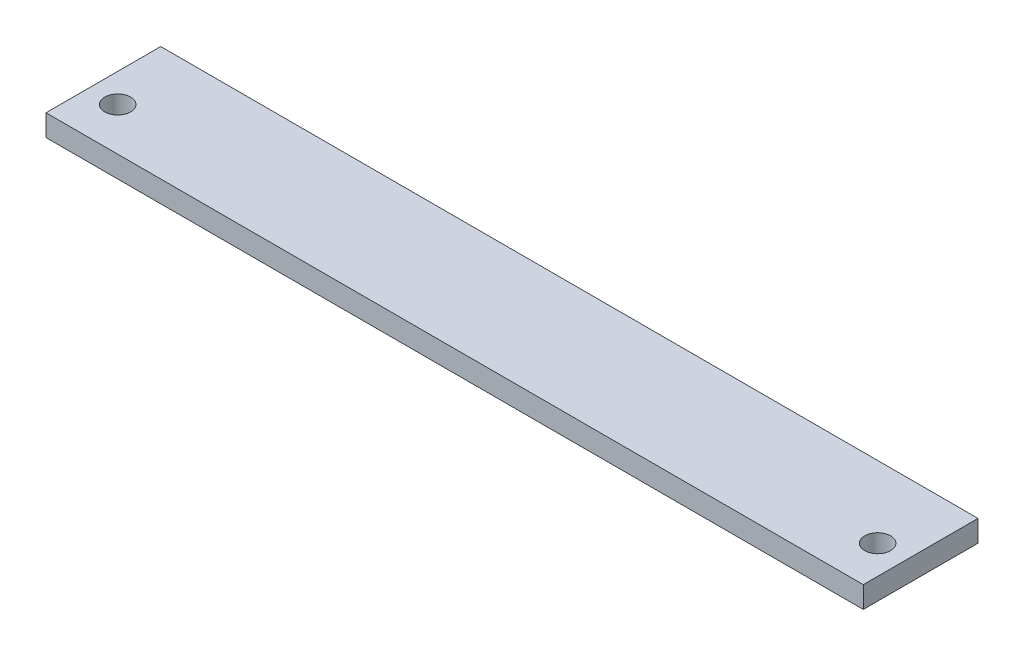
ISO-10303-21;
HEADER;
FILE_DESCRIPTION(('STEP AP214'),'2;1');
FILE_NAME('part.step','',(''),(''),'','','');
FILE_SCHEMA(('AUTOMOTIVE_DESIGN { 1 0 10303 214 1 1 1 1 }'));
ENDSEC;
DATA;
#1=APPLICATION_CONTEXT('core data for automotive mechanical design processes');
#2=APPLICATION_PROTOCOL_DEFINITION('international standard','automotive_design',2000,#1);
#3=PRODUCT_CONTEXT('',#1,'mechanical');
#4=PRODUCT('Part','Part','',(#3));
#5=PRODUCT_RELATED_PRODUCT_CATEGORY('part','',(#4));
#6=PRODUCT_DEFINITION_FORMATION('','',#4);
#7=PRODUCT_DEFINITION_CONTEXT('part definition',#1,'design');
#8=PRODUCT_DEFINITION('design','',#6,#7);
#9=PRODUCT_DEFINITION_SHAPE('','',#8);
#10=(LENGTH_UNIT() NAMED_UNIT(*) SI_UNIT(.MILLI.,.METRE.));
#11=(NAMED_UNIT(*) PLANE_ANGLE_UNIT() SI_UNIT($,.RADIAN.));
#12=(NAMED_UNIT(*) SI_UNIT($,.STERADIAN.) SOLID_ANGLE_UNIT());
#13=UNCERTAINTY_MEASURE_WITH_UNIT(LENGTH_MEASURE(1.E-05),#10,'distance_accuracy_value','');
#14=(GEOMETRIC_REPRESENTATION_CONTEXT(3) GLOBAL_UNCERTAINTY_ASSIGNED_CONTEXT((#13)) GLOBAL_UNIT_ASSIGNED_CONTEXT((#10,
#11,#12)) REPRESENTATION_CONTEXT('',''));
#15=CARTESIAN_POINT('',(0.,0.,0.));
#16=DIRECTION('',(0.,0.,1.));
#17=DIRECTION('',(1.,0.,0.));
#18=AXIS2_PLACEMENT_3D('',#15,#16,#17);
#19=CARTESIAN_POINT('',(-285.,15.,40.));
#20=DIRECTION('',(1.,0.,0.));
#21=DIRECTION('',(0.,0.,-1.));
#22=AXIS2_PLACEMENT_3D('',#19,#20,#21);
#23=PLANE('',#22);
#24=DIRECTION('',(0.,0.,1.));
#25=VECTOR('',#24,1.);
#26=CARTESIAN_POINT('',(-285.,0.,40.));
#27=LINE('',#26,#25);
#28=CARTESIAN_POINT('',(-285.,0.,-40.));
#29=VERTEX_POINT('',#28);
#30=CARTESIAN_POINT('',(-285.,0.,40.));
#31=VERTEX_POINT('',#30);
#32=EDGE_CURVE('E95',#29,#31,#27,.T.);
#33=ORIENTED_EDGE('',*,*,#32,.T.);
#34=DIRECTION('',(0.,-1.,0.));
#35=VECTOR('',#34,1.);
#36=CARTESIAN_POINT('',(-285.,15.,40.));
#37=LINE('',#36,#35);
#38=CARTESIAN_POINT('',(-285.,15.,40.));
#39=VERTEX_POINT('',#38);
#40=EDGE_CURVE('E11',#39,#31,#37,.T.);
#41=ORIENTED_EDGE('',*,*,#40,.F.);
#42=DIRECTION('',(0.,0.,1.));
#43=VECTOR('',#42,1.);
#44=CARTESIAN_POINT('',(-285.,15.,40.));
#45=LINE('',#44,#43);
#46=CARTESIAN_POINT('',(-285.,15.,-40.));
#47=VERTEX_POINT('',#46);
#48=EDGE_CURVE('E83',#47,#39,#45,.T.);
#49=ORIENTED_EDGE('',*,*,#48,.F.);
#50=DIRECTION('',(0.,-1.,0.));
#51=VECTOR('',#50,1.);
#52=CARTESIAN_POINT('',(-285.,15.,-40.));
#53=LINE('',#52,#51);
#54=EDGE_CURVE('E91',#47,#29,#53,.T.);
#55=ORIENTED_EDGE('',*,*,#54,.T.);
#56=EDGE_LOOP('',(#33,#41,#49,#55));
#57=FACE_BOUND('',#56,.T.);
#58=ADVANCED_FACE('F32',(#57),#23,.F.);
#59=CARTESIAN_POINT('',(285.,15.,40.));
#60=DIRECTION('',(0.,0.,-1.));
#61=DIRECTION('',(-1.,0.,0.));
#62=AXIS2_PLACEMENT_3D('',#59,#60,#61);
#63=PLANE('',#62);
#64=DIRECTION('',(1.,0.,0.));
#65=VECTOR('',#64,1.);
#66=CARTESIAN_POINT('',(285.,0.,40.));
#67=LINE('',#66,#65);
#68=CARTESIAN_POINT('',(285.,0.,40.));
#69=VERTEX_POINT('',#68);
#70=EDGE_CURVE('E87',#31,#69,#67,.T.);
#71=ORIENTED_EDGE('',*,*,#70,.T.);
#72=DIRECTION('',(0.,-1.,0.));
#73=VECTOR('',#72,1.);
#74=CARTESIAN_POINT('',(285.,15.,40.));
#75=LINE('',#74,#73);
#76=CARTESIAN_POINT('',(285.,15.,40.));
#77=VERTEX_POINT('',#76);
#78=EDGE_CURVE('E40',#77,#69,#75,.T.);
#79=ORIENTED_EDGE('',*,*,#78,.F.);
#80=DIRECTION('',(1.,0.,0.));
#81=VECTOR('',#80,1.);
#82=CARTESIAN_POINT('',(285.,15.,40.));
#83=LINE('',#82,#81);
#84=EDGE_CURVE('E78',#39,#77,#83,.T.);
#85=ORIENTED_EDGE('',*,*,#84,.F.);
#86=ORIENTED_EDGE('',*,*,#40,.T.);
#87=EDGE_LOOP('',(#71,#79,#85,#86));
#88=FACE_BOUND('',#87,.T.);
#89=ADVANCED_FACE('F86',(#88),#63,.F.);
#90=CARTESIAN_POINT('',(285.,15.,40.));
#91=DIRECTION('',(-1.,0.,0.));
#92=DIRECTION('',(0.,0.,1.));
#93=AXIS2_PLACEMENT_3D('',#90,#91,#92);
#94=PLANE('',#93);
#95=DIRECTION('',(0.,0.,-1.));
#96=VECTOR('',#95,1.);
#97=CARTESIAN_POINT('',(285.,0.,40.));
#98=LINE('',#97,#96);
#99=CARTESIAN_POINT('',(285.,0.,-40.));
#100=VERTEX_POINT('',#99);
#101=EDGE_CURVE('E65',#69,#100,#98,.T.);
#102=ORIENTED_EDGE('',*,*,#101,.T.);
#103=DIRECTION('',(0.,-1.,0.));
#104=VECTOR('',#103,1.);
#105=CARTESIAN_POINT('',(285.,15.,-40.));
#106=LINE('',#105,#104);
#107=CARTESIAN_POINT('',(285.,15.,-40.));
#108=VERTEX_POINT('',#107);
#109=EDGE_CURVE('E88',#108,#100,#106,.T.);
#110=ORIENTED_EDGE('',*,*,#109,.F.);
#111=DIRECTION('',(0.,0.,-1.));
#112=VECTOR('',#111,1.);
#113=CARTESIAN_POINT('',(285.,15.,40.));
#114=LINE('',#113,#112);
#115=EDGE_CURVE('E81',#77,#108,#114,.T.);
#116=ORIENTED_EDGE('',*,*,#115,.F.);
#117=ORIENTED_EDGE('',*,*,#78,.T.);
#118=EDGE_LOOP('',(#102,#110,#116,#117));
#119=FACE_BOUND('',#118,.T.);
#120=ADVANCED_FACE('F89',(#119),#94,.F.);
#121=CARTESIAN_POINT('',(285.,15.,-40.));
#122=DIRECTION('',(0.,0.,1.));
#123=DIRECTION('',(1.,0.,0.));
#124=AXIS2_PLACEMENT_3D('',#121,#122,#123);
#125=PLANE('',#124);
#126=DIRECTION('',(-1.,0.,0.));
#127=VECTOR('',#126,1.);
#128=CARTESIAN_POINT('',(285.,0.,-40.));
#129=LINE('',#128,#127);
#130=EDGE_CURVE('E71',#100,#29,#129,.T.);
#131=ORIENTED_EDGE('',*,*,#130,.T.);
#132=ORIENTED_EDGE('',*,*,#54,.F.);
#133=DIRECTION('',(-1.,0.,0.));
#134=VECTOR('',#133,1.);
#135=CARTESIAN_POINT('',(285.,15.,-40.));
#136=LINE('',#135,#134);
#137=EDGE_CURVE('E48',#108,#47,#136,.T.);
#138=ORIENTED_EDGE('',*,*,#137,.F.);
#139=ORIENTED_EDGE('',*,*,#109,.T.);
#140=EDGE_LOOP('',(#131,#132,#138,#139));
#141=FACE_BOUND('',#140,.T.);
#142=ADVANCED_FACE('F103',(#141),#125,.F.);
#143=CARTESIAN_POINT('',(0.,15.,0.));
#144=DIRECTION('',(0.,1.,0.));
#145=DIRECTION('',(0.,0.,1.));
#146=AXIS2_PLACEMENT_3D('',#143,#144,#145);
#147=PLANE('',#146);
#148=CARTESIAN_POINT('',(265.,15.,10.));
#149=DIRECTION('',(0.,-1.,0.));
#150=DIRECTION('',(0.,0.,1.));
#151=AXIS2_PLACEMENT_3D('',#148,#149,#150);
#152=CIRCLE('',#151,8.99999999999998);
#153=CARTESIAN_POINT('',(265.,15.,19.));
#154=VERTEX_POINT('',#153);
#155=EDGE_CURVE('E115',#154,#154,#152,.T.);
#156=ORIENTED_EDGE('',*,*,#155,.T.);
#157=EDGE_LOOP('',(#156));
#158=FACE_BOUND('',#157,.T.);
#159=CARTESIAN_POINT('',(-265.,15.,10.));
#160=DIRECTION('',(0.,1.,0.));
#161=DIRECTION('',(0.,0.,1.));
#162=AXIS2_PLACEMENT_3D('',#159,#160,#161);
#163=CIRCLE('',#162,8.99999999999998);
#164=CARTESIAN_POINT('',(-265.,15.,19.));
#165=VERTEX_POINT('',#164);
#166=EDGE_CURVE('E109',#165,#165,#163,.T.);
#167=ORIENTED_EDGE('',*,*,#166,.F.);
#168=EDGE_LOOP('',(#167));
#169=FACE_BOUND('',#168,.T.);
#170=ORIENTED_EDGE('',*,*,#48,.T.);
#171=ORIENTED_EDGE('',*,*,#84,.T.);
#172=ORIENTED_EDGE('',*,*,#115,.T.);
#173=ORIENTED_EDGE('',*,*,#137,.T.);
#174=EDGE_LOOP('',(#170,#171,#172,#173));
#175=FACE_BOUND('',#174,.T.);
#176=ADVANCED_FACE('F79',(#158,#169,#175),#147,.T.);
#177=CARTESIAN_POINT('',(0.,0.,0.));
#178=DIRECTION('',(0.,1.,0.));
#179=DIRECTION('',(0.,0.,1.));
#180=AXIS2_PLACEMENT_3D('',#177,#178,#179);
#181=PLANE('',#180);
#182=CARTESIAN_POINT('',(265.,0.,10.));
#183=DIRECTION('',(0.,-1.,0.));
#184=DIRECTION('',(0.,0.,1.));
#185=AXIS2_PLACEMENT_3D('',#182,#183,#184);
#186=CIRCLE('',#185,8.99999999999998);
#187=CARTESIAN_POINT('',(265.,0.,19.));
#188=VERTEX_POINT('',#187);
#189=EDGE_CURVE('E112',#188,#188,#186,.T.);
#190=ORIENTED_EDGE('',*,*,#189,.F.);
#191=EDGE_LOOP('',(#190));
#192=FACE_BOUND('',#191,.T.);
#193=CARTESIAN_POINT('',(-265.,0.,10.));
#194=DIRECTION('',(0.,1.,0.));
#195=DIRECTION('',(0.,0.,1.));
#196=AXIS2_PLACEMENT_3D('',#193,#194,#195);
#197=CIRCLE('',#196,8.99999999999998);
#198=CARTESIAN_POINT('',(-265.,0.,19.));
#199=VERTEX_POINT('',#198);
#200=EDGE_CURVE('E98',#199,#199,#197,.T.);
#201=ORIENTED_EDGE('',*,*,#200,.T.);
#202=EDGE_LOOP('',(#201));
#203=FACE_BOUND('',#202,.T.);
#204=ORIENTED_EDGE('',*,*,#32,.F.);
#205=ORIENTED_EDGE('',*,*,#130,.F.);
#206=ORIENTED_EDGE('',*,*,#101,.F.);
#207=ORIENTED_EDGE('',*,*,#70,.F.);
#208=EDGE_LOOP('',(#204,#205,#206,#207));
#209=FACE_BOUND('',#208,.T.);
#210=ADVANCED_FACE('F106',(#192,#203,#209),#181,.F.);
#211=CARTESIAN_POINT('',(-265.,0.,10.));
#212=DIRECTION('',(0.,1.,0.));
#213=DIRECTION('',(0.,0.,1.));
#214=AXIS2_PLACEMENT_3D('',#211,#212,#213);
#215=CYLINDRICAL_SURFACE('',#214,8.99999999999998);
#216=ORIENTED_EDGE('',*,*,#200,.F.);
#217=EDGE_LOOP('',(#216));
#218=FACE_BOUND('',#217,.T.);
#219=ORIENTED_EDGE('',*,*,#166,.T.);
#220=EDGE_LOOP('',(#219));
#221=FACE_BOUND('',#220,.T.);
#222=ADVANCED_FACE('F126',(#218,#221),#215,.F.);
#223=CARTESIAN_POINT('',(265.,0.,10.));
#224=DIRECTION('',(0.,1.,0.));
#225=DIRECTION('',(0.,0.,1.));
#226=AXIS2_PLACEMENT_3D('',#223,#224,#225);
#227=CYLINDRICAL_SURFACE('',#226,8.99999999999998);
#228=ORIENTED_EDGE('',*,*,#189,.T.);
#229=EDGE_LOOP('',(#228));
#230=FACE_BOUND('',#229,.T.);
#231=ORIENTED_EDGE('',*,*,#155,.F.);
#232=EDGE_LOOP('',(#231));
#233=FACE_BOUND('',#232,.T.);
#234=ADVANCED_FACE('F121',(#230,#233),#227,.F.);
#235=CLOSED_SHELL('',(#58,#89,#120,#142,#176,#210,#222,#234));
#236=MANIFOLD_SOLID_BREP('B2',#235);
#237=ADVANCED_BREP_SHAPE_REPRESENTATION('',(#18,#236),#14);
#238=SHAPE_DEFINITION_REPRESENTATION(#9,#237);
ENDSEC;
END-ISO-10303-21;
